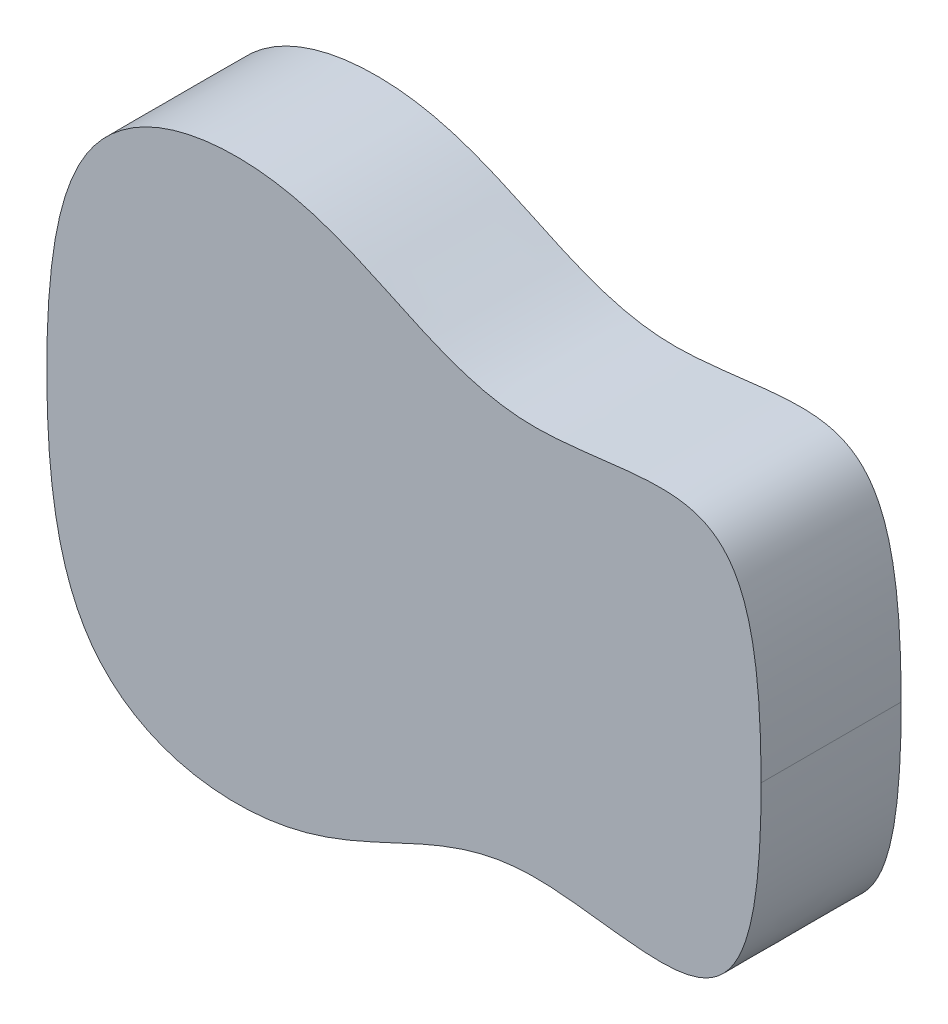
from build123d import *

# Parameters (mm, degrees)
BOSS_EXTRUDE1_DEPTH = 100


with BuildPart() as part:
    # Sketch2 → Boss-Extrude1 (new body)
    with BuildSketch(Plane.XY):
        with BuildLine():
            add(Edge.make_bspline(
                [(0, 0), (0, 71.669053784), (21.885003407, 187.667022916), (201.910389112, 219.67927304), (295.601821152, 117.879681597), (475.29377784, 163.011614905), (510, 115.018525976), (510, 0)],
                knots=[0, 0, 0, 0, 0.130854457, 0.316703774, 0.62472215, 0.773546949, 1, 1, 1, 1], degree=3))
            add(Edge.make_bspline(
                [(0, 0), (0, -71.669053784), (21.885003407, -187.667022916), (201.910389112, -219.67927304), (295.601821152, -117.879681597), (475.29377784, -163.011614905), (510, -115.018525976), (510, 0)],
                knots=[0, 0, 0, 0, 0.130854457, 0.316703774, 0.62472215, 0.773546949, 1, 1, 1, 1], degree=3))
        make_face()
    extrude(amount=BOSS_EXTRUDE1_DEPTH)


solid = part.part
